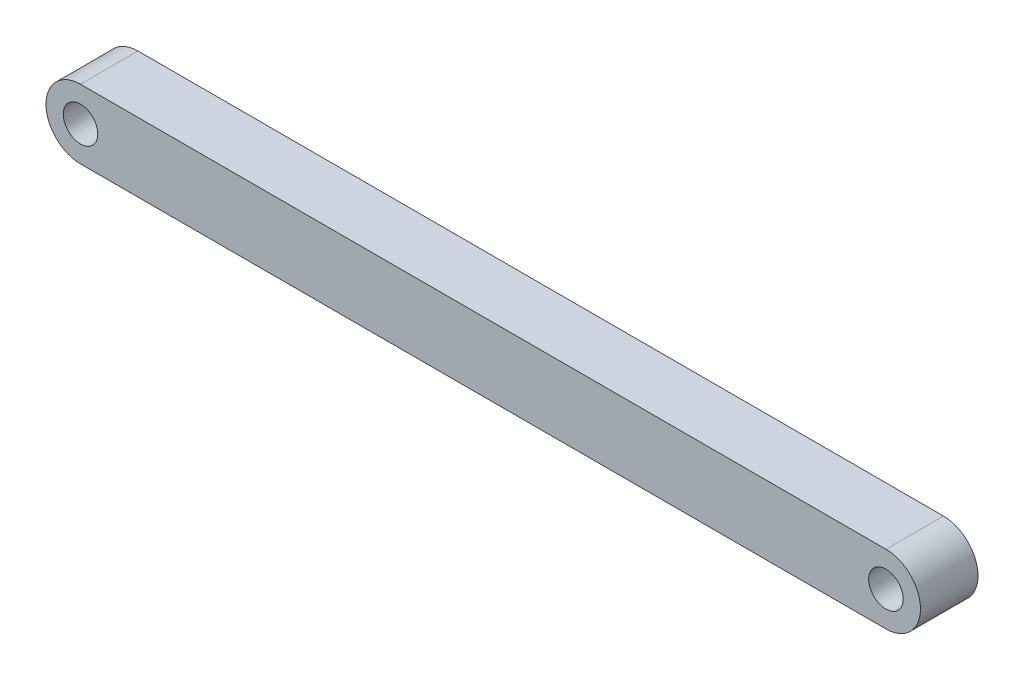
ISO-10303-21;
HEADER;
FILE_DESCRIPTION(('STEP AP214'),'2;1');
FILE_NAME('part.step','',(''),(''),'','','');
FILE_SCHEMA(('AUTOMOTIVE_DESIGN { 1 0 10303 214 1 1 1 1 }'));
ENDSEC;
DATA;
#1=APPLICATION_CONTEXT('core data for automotive mechanical design processes');
#2=APPLICATION_PROTOCOL_DEFINITION('international standard','automotive_design',2000,#1);
#3=PRODUCT_CONTEXT('',#1,'mechanical');
#4=PRODUCT('Part','Part','',(#3));
#5=PRODUCT_RELATED_PRODUCT_CATEGORY('part','',(#4));
#6=PRODUCT_DEFINITION_FORMATION('','',#4);
#7=PRODUCT_DEFINITION_CONTEXT('part definition',#1,'design');
#8=PRODUCT_DEFINITION('design','',#6,#7);
#9=PRODUCT_DEFINITION_SHAPE('','',#8);
#10=(LENGTH_UNIT() NAMED_UNIT(*) SI_UNIT(.MILLI.,.METRE.));
#11=(NAMED_UNIT(*) PLANE_ANGLE_UNIT() SI_UNIT($,.RADIAN.));
#12=(NAMED_UNIT(*) SI_UNIT($,.STERADIAN.) SOLID_ANGLE_UNIT());
#13=UNCERTAINTY_MEASURE_WITH_UNIT(LENGTH_MEASURE(1.E-05),#10,'distance_accuracy_value','');
#14=(GEOMETRIC_REPRESENTATION_CONTEXT(3) GLOBAL_UNCERTAINTY_ASSIGNED_CONTEXT((#13)) GLOBAL_UNIT_ASSIGNED_CONTEXT((#10,
#11,#12)) REPRESENTATION_CONTEXT('',''));
#15=CARTESIAN_POINT('',(0.,0.,0.));
#16=DIRECTION('',(0.,0.,1.));
#17=DIRECTION('',(1.,0.,0.));
#18=AXIS2_PLACEMENT_3D('',#15,#16,#17);
#19=CARTESIAN_POINT('',(-35.,0.,5.));
#20=DIRECTION('',(0.,0.,1.));
#21=DIRECTION('',(1.,0.,0.));
#22=AXIS2_PLACEMENT_3D('',#19,#20,#21);
#23=PLANE('',#22);
#24=CARTESIAN_POINT('',(-35.,0.,5.));
#25=DIRECTION('',(0.,0.,1.));
#26=DIRECTION('',(1.,0.,0.));
#27=AXIS2_PLACEMENT_3D('',#24,#25,#26);
#28=CIRCLE('',#27,1.5);
#29=CARTESIAN_POINT('',(-33.5,0.,5.));
#30=VERTEX_POINT('',#29);
#31=EDGE_CURVE('E102',#30,#30,#28,.T.);
#32=ORIENTED_EDGE('',*,*,#31,.F.);
#33=EDGE_LOOP('',(#32));
#34=FACE_BOUND('',#33,.T.);
#35=CARTESIAN_POINT('',(-35.,0.,5.));
#36=DIRECTION('',(0.,0.,1.));
#37=DIRECTION('',(1.,0.,0.));
#38=AXIS2_PLACEMENT_3D('',#35,#36,#37);
#39=CIRCLE('',#38,3.);
#40=CARTESIAN_POINT('',(-35.,3.,5.));
#41=VERTEX_POINT('',#40);
#42=CARTESIAN_POINT('',(-35.,-3.,5.));
#43=VERTEX_POINT('',#42);
#44=EDGE_CURVE('E87',#41,#43,#39,.T.);
#45=ORIENTED_EDGE('',*,*,#44,.T.);
#46=DIRECTION('',(1.,0.,0.));
#47=VECTOR('',#46,1.);
#48=CARTESIAN_POINT('',(-35.,-3.,5.));
#49=LINE('',#48,#47);
#50=CARTESIAN_POINT('',(35.,-3.,5.));
#51=VERTEX_POINT('',#50);
#52=EDGE_CURVE('E82',#43,#51,#49,.T.);
#53=ORIENTED_EDGE('',*,*,#52,.T.);
#54=CARTESIAN_POINT('',(35.,0.,5.));
#55=DIRECTION('',(0.,0.,1.));
#56=DIRECTION('',(1.,0.,0.));
#57=AXIS2_PLACEMENT_3D('',#54,#55,#56);
#58=CIRCLE('',#57,3.);
#59=CARTESIAN_POINT('',(35.,3.,5.));
#60=VERTEX_POINT('',#59);
#61=EDGE_CURVE('E85',#51,#60,#58,.T.);
#62=ORIENTED_EDGE('',*,*,#61,.T.);
#63=DIRECTION('',(-1.,0.,0.));
#64=VECTOR('',#63,1.);
#65=CARTESIAN_POINT('',(-35.,3.,5.));
#66=LINE('',#65,#64);
#67=EDGE_CURVE('E52',#60,#41,#66,.T.);
#68=ORIENTED_EDGE('',*,*,#67,.T.);
#69=EDGE_LOOP('',(#45,#53,#62,#68));
#70=FACE_BOUND('',#69,.T.);
#71=CARTESIAN_POINT('',(35.,0.,5.));
#72=DIRECTION('',(0.,0.,1.));
#73=DIRECTION('',(1.,0.,0.));
#74=AXIS2_PLACEMENT_3D('',#71,#72,#73);
#75=CIRCLE('',#74,1.5);
#76=CARTESIAN_POINT('',(36.5,0.,5.));
#77=VERTEX_POINT('',#76);
#78=EDGE_CURVE('E117',#77,#77,#75,.T.);
#79=ORIENTED_EDGE('',*,*,#78,.F.);
#80=EDGE_LOOP('',(#79));
#81=FACE_BOUND('',#80,.T.);
#82=ADVANCED_FACE('F35',(#34,#70,#81),#23,.T.);
#83=CARTESIAN_POINT('',(-35.,0.,0.));
#84=DIRECTION('',(0.,0.,1.));
#85=DIRECTION('',(1.,0.,0.));
#86=AXIS2_PLACEMENT_3D('',#83,#84,#85);
#87=PLANE('',#86);
#88=CARTESIAN_POINT('',(-35.,0.,0.));
#89=DIRECTION('',(0.,0.,1.));
#90=DIRECTION('',(1.,0.,0.));
#91=AXIS2_PLACEMENT_3D('',#88,#89,#90);
#92=CIRCLE('',#91,1.5);
#93=CARTESIAN_POINT('',(-33.5,0.,0.));
#94=VERTEX_POINT('',#93);
#95=EDGE_CURVE('E114',#94,#94,#92,.T.);
#96=ORIENTED_EDGE('',*,*,#95,.T.);
#97=EDGE_LOOP('',(#96));
#98=FACE_BOUND('',#97,.T.);
#99=CARTESIAN_POINT('',(-35.,0.,0.));
#100=DIRECTION('',(0.,0.,1.));
#101=DIRECTION('',(1.,0.,0.));
#102=AXIS2_PLACEMENT_3D('',#99,#100,#101);
#103=CIRCLE('',#102,3.);
#104=CARTESIAN_POINT('',(-35.,3.,0.));
#105=VERTEX_POINT('',#104);
#106=CARTESIAN_POINT('',(-35.,-3.,0.));
#107=VERTEX_POINT('',#106);
#108=EDGE_CURVE('E99',#105,#107,#103,.T.);
#109=ORIENTED_EDGE('',*,*,#108,.F.);
#110=DIRECTION('',(-1.,0.,0.));
#111=VECTOR('',#110,1.);
#112=CARTESIAN_POINT('',(-35.,3.,0.));
#113=LINE('',#112,#111);
#114=CARTESIAN_POINT('',(35.,3.,0.));
#115=VERTEX_POINT('',#114);
#116=EDGE_CURVE('E75',#115,#105,#113,.T.);
#117=ORIENTED_EDGE('',*,*,#116,.F.);
#118=CARTESIAN_POINT('',(35.,0.,0.));
#119=DIRECTION('',(0.,0.,1.));
#120=DIRECTION('',(1.,0.,0.));
#121=AXIS2_PLACEMENT_3D('',#118,#119,#120);
#122=CIRCLE('',#121,3.);
#123=CARTESIAN_POINT('',(35.,-3.,0.));
#124=VERTEX_POINT('',#123);
#125=EDGE_CURVE('E69',#124,#115,#122,.T.);
#126=ORIENTED_EDGE('',*,*,#125,.F.);
#127=DIRECTION('',(1.,0.,0.));
#128=VECTOR('',#127,1.);
#129=CARTESIAN_POINT('',(-35.,-3.,0.));
#130=LINE('',#129,#128);
#131=EDGE_CURVE('E91',#107,#124,#130,.T.);
#132=ORIENTED_EDGE('',*,*,#131,.F.);
#133=EDGE_LOOP('',(#109,#117,#126,#132));
#134=FACE_BOUND('',#133,.T.);
#135=CARTESIAN_POINT('',(35.,0.,0.));
#136=DIRECTION('',(0.,0.,1.));
#137=DIRECTION('',(1.,0.,0.));
#138=AXIS2_PLACEMENT_3D('',#135,#136,#137);
#139=CIRCLE('',#138,1.5);
#140=CARTESIAN_POINT('',(36.5,0.,0.));
#141=VERTEX_POINT('',#140);
#142=EDGE_CURVE('E120',#141,#141,#139,.T.);
#143=ORIENTED_EDGE('',*,*,#142,.T.);
#144=EDGE_LOOP('',(#143));
#145=FACE_BOUND('',#144,.T.);
#146=ADVANCED_FACE('F110',(#98,#134,#145),#87,.F.);
#147=CARTESIAN_POINT('',(-35.,0.,5.));
#148=DIRECTION('',(0.,0.,-1.));
#149=DIRECTION('',(-1.,0.,0.));
#150=AXIS2_PLACEMENT_3D('',#147,#148,#149);
#151=CYLINDRICAL_SURFACE('',#150,3.);
#152=ORIENTED_EDGE('',*,*,#108,.T.);
#153=DIRECTION('',(0.,0.,-1.));
#154=VECTOR('',#153,1.);
#155=CARTESIAN_POINT('',(-35.,-3.,5.));
#156=LINE('',#155,#154);
#157=EDGE_CURVE('E11',#43,#107,#156,.T.);
#158=ORIENTED_EDGE('',*,*,#157,.F.);
#159=ORIENTED_EDGE('',*,*,#44,.F.);
#160=DIRECTION('',(0.,0.,-1.));
#161=VECTOR('',#160,1.);
#162=CARTESIAN_POINT('',(-35.,3.,5.));
#163=LINE('',#162,#161);
#164=EDGE_CURVE('E95',#41,#105,#163,.T.);
#165=ORIENTED_EDGE('',*,*,#164,.T.);
#166=EDGE_LOOP('',(#152,#158,#159,#165));
#167=FACE_BOUND('',#166,.T.);
#168=ADVANCED_FACE('F37',(#167),#151,.T.);
#169=CARTESIAN_POINT('',(-35.,-3.,5.));
#170=DIRECTION('',(0.,1.,0.));
#171=DIRECTION('',(0.,0.,1.));
#172=AXIS2_PLACEMENT_3D('',#169,#170,#171);
#173=PLANE('',#172);
#174=ORIENTED_EDGE('',*,*,#131,.T.);
#175=DIRECTION('',(0.,0.,-1.));
#176=VECTOR('',#175,1.);
#177=CARTESIAN_POINT('',(35.,-3.,5.));
#178=LINE('',#177,#176);
#179=EDGE_CURVE('E44',#51,#124,#178,.T.);
#180=ORIENTED_EDGE('',*,*,#179,.F.);
#181=ORIENTED_EDGE('',*,*,#52,.F.);
#182=ORIENTED_EDGE('',*,*,#157,.T.);
#183=EDGE_LOOP('',(#174,#180,#181,#182));
#184=FACE_BOUND('',#183,.T.);
#185=ADVANCED_FACE('F90',(#184),#173,.F.);
#186=CARTESIAN_POINT('',(35.,0.,5.));
#187=DIRECTION('',(0.,0.,-1.));
#188=DIRECTION('',(-1.,0.,0.));
#189=AXIS2_PLACEMENT_3D('',#186,#187,#188);
#190=CYLINDRICAL_SURFACE('',#189,3.);
#191=ORIENTED_EDGE('',*,*,#125,.T.);
#192=DIRECTION('',(0.,0.,-1.));
#193=VECTOR('',#192,1.);
#194=CARTESIAN_POINT('',(35.,3.,5.));
#195=LINE('',#194,#193);
#196=EDGE_CURVE('E92',#60,#115,#195,.T.);
#197=ORIENTED_EDGE('',*,*,#196,.F.);
#198=ORIENTED_EDGE('',*,*,#61,.F.);
#199=ORIENTED_EDGE('',*,*,#179,.T.);
#200=EDGE_LOOP('',(#191,#197,#198,#199));
#201=FACE_BOUND('',#200,.T.);
#202=ADVANCED_FACE('F93',(#201),#190,.T.);
#203=CARTESIAN_POINT('',(-35.,3.,5.));
#204=DIRECTION('',(0.,-1.,0.));
#205=DIRECTION('',(0.,0.,-1.));
#206=AXIS2_PLACEMENT_3D('',#203,#204,#205);
#207=PLANE('',#206);
#208=ORIENTED_EDGE('',*,*,#116,.T.);
#209=ORIENTED_EDGE('',*,*,#164,.F.);
#210=ORIENTED_EDGE('',*,*,#67,.F.);
#211=ORIENTED_EDGE('',*,*,#196,.T.);
#212=EDGE_LOOP('',(#208,#209,#210,#211));
#213=FACE_BOUND('',#212,.T.);
#214=ADVANCED_FACE('F107',(#213),#207,.F.);
#215=CARTESIAN_POINT('',(-35.,0.,5.));
#216=DIRECTION('',(0.,0.,-1.));
#217=DIRECTION('',(-1.,0.,0.));
#218=AXIS2_PLACEMENT_3D('',#215,#216,#217);
#219=CYLINDRICAL_SURFACE('',#218,1.5);
#220=ORIENTED_EDGE('',*,*,#31,.T.);
#221=EDGE_LOOP('',(#220));
#222=FACE_BOUND('',#221,.T.);
#223=ORIENTED_EDGE('',*,*,#95,.F.);
#224=EDGE_LOOP('',(#223));
#225=FACE_BOUND('',#224,.T.);
#226=ADVANCED_FACE('F138',(#222,#225),#219,.F.);
#227=CARTESIAN_POINT('',(35.,0.,5.));
#228=DIRECTION('',(0.,0.,-1.));
#229=DIRECTION('',(-1.,0.,0.));
#230=AXIS2_PLACEMENT_3D('',#227,#228,#229);
#231=CYLINDRICAL_SURFACE('',#230,1.5);
#232=ORIENTED_EDGE('',*,*,#78,.T.);
#233=EDGE_LOOP('',(#232));
#234=FACE_BOUND('',#233,.T.);
#235=ORIENTED_EDGE('',*,*,#142,.F.);
#236=EDGE_LOOP('',(#235));
#237=FACE_BOUND('',#236,.T.);
#238=ADVANCED_FACE('F126',(#234,#237),#231,.F.);
#239=CLOSED_SHELL('',(#82,#146,#168,#185,#202,#214,#226,#238));
#240=MANIFOLD_SOLID_BREP('B2',#239);
#241=ADVANCED_BREP_SHAPE_REPRESENTATION('',(#18,#240),#14);
#242=SHAPE_DEFINITION_REPRESENTATION(#9,#241);
ENDSEC;
END-ISO-10303-21;
